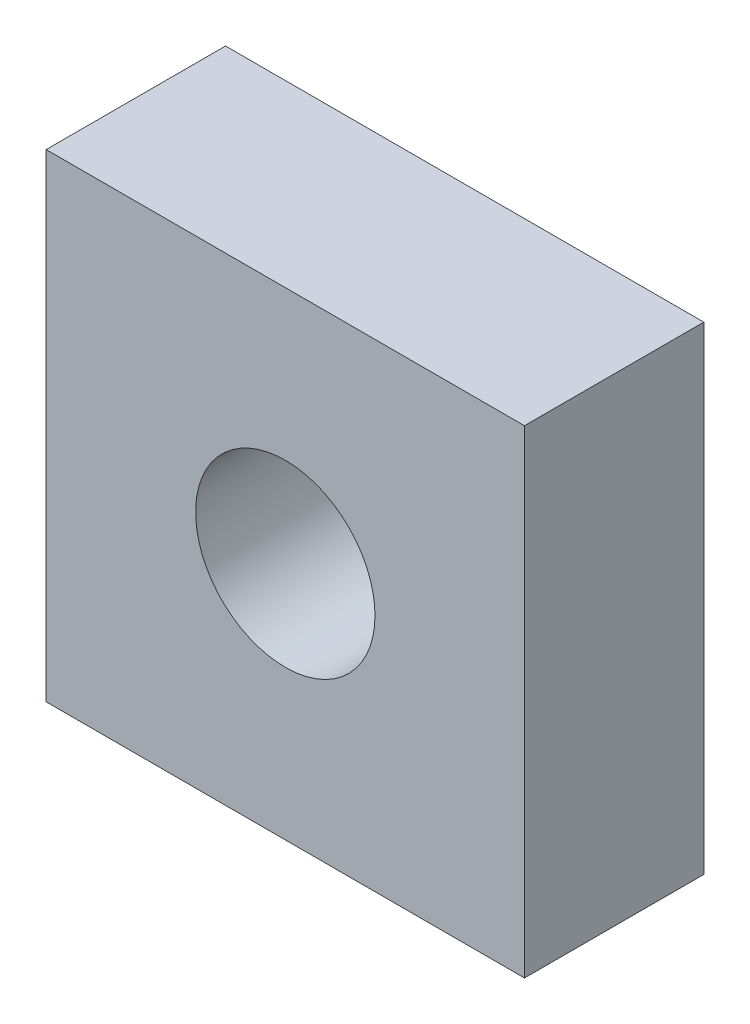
from build123d import *

# Parameters (mm, degrees)
ESQUISSE1_W      = 8
ESQUISSE1_H      = 8
ESQUISSE1_R      = 1.5
EXTRUSION1_DEPTH = 3


with BuildPart() as part:
    # Esquisse1 → Extrusion1 (new body)
    with BuildSketch(Plane.XY):
        Rectangle(ESQUISSE1_W, ESQUISSE1_H)
        Circle(ESQUISSE1_R, mode=Mode.SUBTRACT)
    extrude(amount=EXTRUSION1_DEPTH)


solid = part.part
